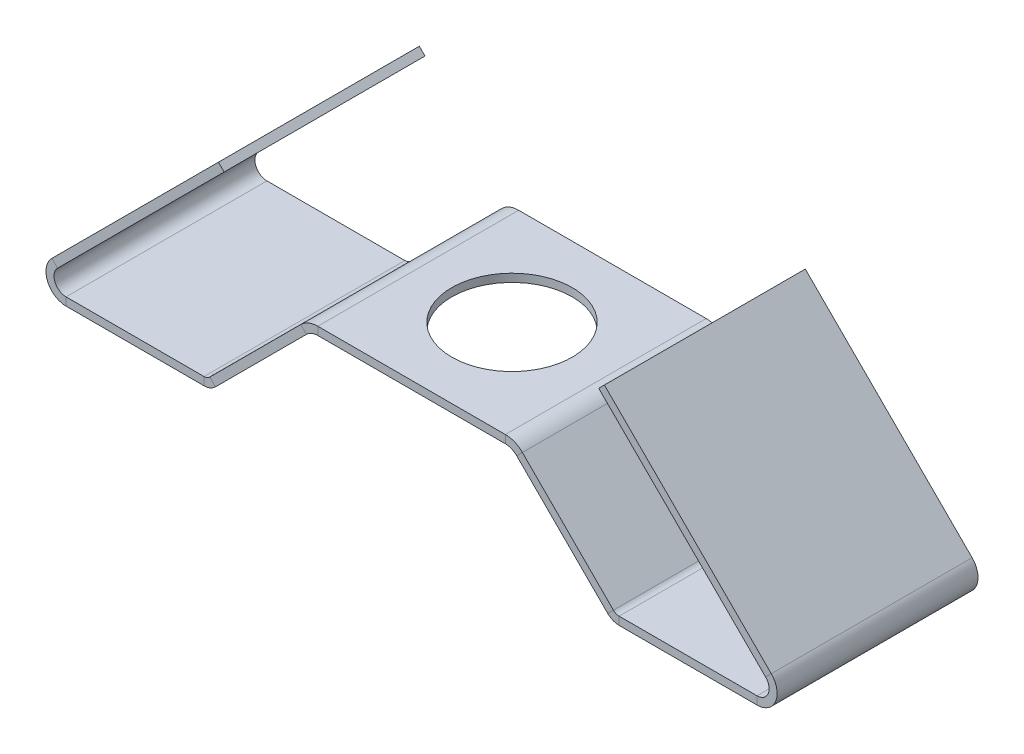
from build123d import *

# Parameters (mm, degrees)
SKETCH10_W = 0.2
SKETCH10_H = 5
SKETCH11_R = 1.5
HOLE_DEPTH = 10.815803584


with BuildPart() as part:
    # Sweep3: sweep along a path in Sketch9
    with BuildLine(Plane.XY) as sweep3_path:
        Line((-4.807106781, 5), (-8.953553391, 0.853553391))
        ThreePointArc((-8.953553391, 0.853553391), (-9.061939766, 0.308658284), (-8.6, 0))
        Line((-8.6, 0), (-5.165685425, 0))
        ThreePointArc((-5.165685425, 0), (-5.012612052, 0.030448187), (-4.882842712, 0.117157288))
        Line((-4.882842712, 0.117157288), (-2.617157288, 2.382842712))
        ThreePointArc((-2.617157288, 2.382842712), (-2.487387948, 2.469551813), (-2.334314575, 2.5))
        Line((-2.334314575, 2.5), (2.334314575, 2.5))
        ThreePointArc((2.334314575, 2.5), (2.487387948, 2.469551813), (2.617157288, 2.382842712))
        Line((2.617157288, 2.382842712), (4.882842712, 0.117157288))
        ThreePointArc((4.882842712, 0.117157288), (5.012612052, 0.030448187), (5.165685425, 0))
        Line((5.165685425, 0), (8.6, 0))
        ThreePointArc((8.6, 0), (9.062021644, 0.308856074), (8.953250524, 0.853855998))
        Line((8.953250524, 0.853855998), (4.8, 5))
    # Sketch10 → Sweep3 (sweep)
    with BuildSketch(Plane(origin=(-4.807106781, 5, 0), x_dir=(-0.7071067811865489, 0.7071067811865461, 0), z_dir=(-0.7071067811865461, -0.7071067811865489, 0))):
        with Locations((-0.1, 0)):
            Rectangle(SKETCH10_W, SKETCH10_H)
    sweep(path=sweep3_path.line)

    # Sketch11 → hole (cut, through all)
    with BuildSketch(Plane(origin=(0, 2.7, 0), x_dir=(1, 0, 0), z_dir=(0, 1, 0))):
        with Locations(Location((0, 0, 0), (0, 0, 270))):
            Circle(SKETCH11_R)
    extrude(amount=-HOLE_DEPTH, mode=Mode.SUBTRACT)


solid = part.part
